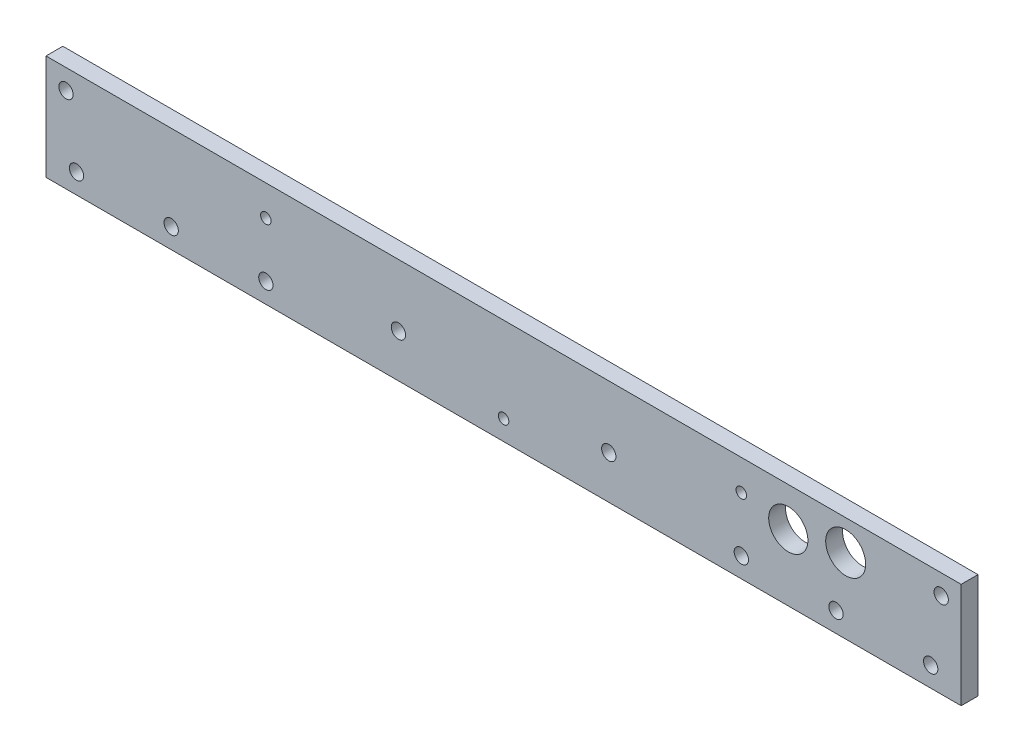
from build123d import *

# Parameters (mm, degrees)
SKIZZE1_W                       = 435
SKIZZE1_H                       = 50
BASIS_LINEAR_AUSTRAGEN_DEPTH    = 8
M6_BEFESTIGUNG_D                = 5
M8_SCHARNIER_D                  = 6.8
M8_HALTER_D                     = 6.8
LINEARES_MUSTER1_COUNT          = 2
LINEARES_MUSTER1_PITCH          = 416
M8_ANSCHLAG_D                   = 6.8
G1_2_GEWINDEBOHRUNG1_D          = 19
SCHNITT_LINEAR_AUSTRAGEN1_REACH = 439.937
SKIZZE32_R                      = 9.315


with BuildPart() as part:
    # Skizze1 → Basis-Linear austragen (new body)
    with BuildSketch(Plane.XY):
        with Locations((217.5, 25)):
            Rectangle(SKIZZE1_W, SKIZZE1_H)
    extrude(amount=BASIS_LINEAR_AUSTRAGEN_DEPTH)

    # M6 Befestigung (through all)
    with Locations(Plane.XY.offset(8)):
        with Locations((104.5, 35.5), (217.5, 9.5), (330.5, 35.5)):
            Hole(M6_BEFESTIGUNG_D / 2)

    # M8 Scharnier (through all)
    with Locations(Plane.XY.offset(8)):
        with Locations((104.5, 9.5), (59.5, 9.5), (14.5, 9.5), (330.5, 9.5), (375.5, 9.5), (420.5, 9.5)):
            Hole(M8_SCHARNIER_D / 2)

    # M8 Halter (through all)
    with Locations(Plane.XY.offset(8)):
        with Locations((9.5, 40.5)):
            m8_halter = Hole(M8_HALTER_D / 2)

    # Lineares Muster1: M8 Halter ×2
    with Locations(*[(i * LINEARES_MUSTER1_PITCH, 0, 0) for i in range(1, LINEARES_MUSTER1_COUNT)]):
        add(m8_halter, mode=Mode.SUBTRACT)

    # M8 Anschlag (through all)
    with Locations(Plane.XY.offset(8)):
        with Locations((167.5, 20.5), (267.5, 20.5)):
            Hole(M8_ANSCHLAG_D / 2)

    # G1_2 Gewindebohrung1 (through all)
    with Locations(Plane.XY.offset(8)):
        with Locations((380.110073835, 35.587097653)):
            Hole(G1_2_GEWINDEBOHRUNG1_D / 2)

    # Skizze32 → Schnitt-Linear austragen1 (cut, up to next)
    with BuildSketch(Plane.XY.offset(8), mode=Mode.PRIVATE) as schnitt_linear_austragen1_sk1:
        with Locations((352.826244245, 31.601595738)):
            Circle(SKIZZE32_R)
    schnitt_linear_austragen1_tool1 = extrude(schnitt_linear_austragen1_sk1.sketch, amount=-SCHNITT_LINEAR_AUSTRAGEN1_REACH, mode=Mode.PRIVATE) & part.part
    add(schnitt_linear_austragen1_tool1.solids().sort_by_distance((352.826244, 31.601596, 8))[0], mode=Mode.SUBTRACT)


solid = part.part
